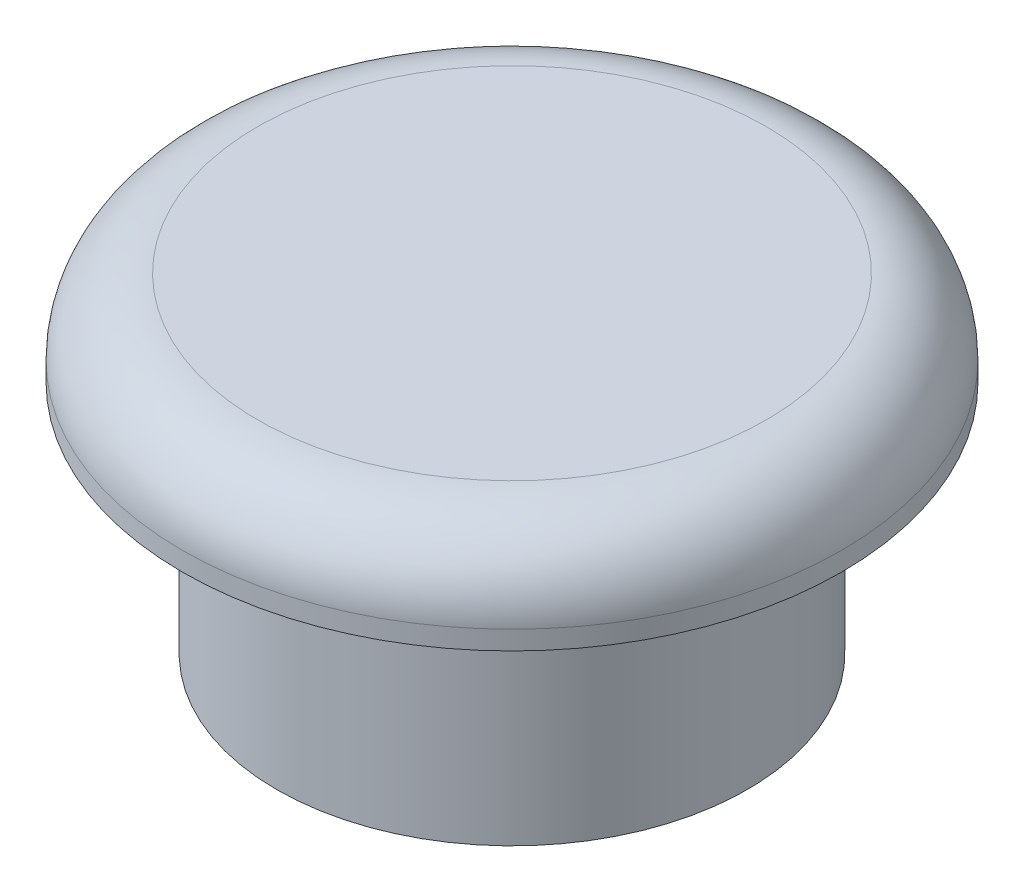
ISO-10303-21;
HEADER;
FILE_DESCRIPTION(('STEP AP214'),'2;1');
FILE_NAME('part.step','',(''),(''),'','','');
FILE_SCHEMA(('AUTOMOTIVE_DESIGN { 1 0 10303 214 1 1 1 1 }'));
ENDSEC;
DATA;
#1=APPLICATION_CONTEXT('core data for automotive mechanical design processes');
#2=APPLICATION_PROTOCOL_DEFINITION('international standard','automotive_design',2000,#1);
#3=PRODUCT_CONTEXT('',#1,'mechanical');
#4=PRODUCT('Part','Part','',(#3));
#5=PRODUCT_RELATED_PRODUCT_CATEGORY('part','',(#4));
#6=PRODUCT_DEFINITION_FORMATION('','',#4);
#7=PRODUCT_DEFINITION_CONTEXT('part definition',#1,'design');
#8=PRODUCT_DEFINITION('design','',#6,#7);
#9=PRODUCT_DEFINITION_SHAPE('','',#8);
#10=(LENGTH_UNIT() NAMED_UNIT(*) SI_UNIT(.MILLI.,.METRE.));
#11=(NAMED_UNIT(*) PLANE_ANGLE_UNIT() SI_UNIT($,.RADIAN.));
#12=(NAMED_UNIT(*) SI_UNIT($,.STERADIAN.) SOLID_ANGLE_UNIT());
#13=UNCERTAINTY_MEASURE_WITH_UNIT(LENGTH_MEASURE(1.E-05),#10,'distance_accuracy_value','');
#14=(GEOMETRIC_REPRESENTATION_CONTEXT(3) GLOBAL_UNCERTAINTY_ASSIGNED_CONTEXT((#13)) GLOBAL_UNIT_ASSIGNED_CONTEXT((#10,
#11,#12)) REPRESENTATION_CONTEXT('',''));
#15=CARTESIAN_POINT('',(0.,0.,0.));
#16=DIRECTION('',(0.,0.,1.));
#17=DIRECTION('',(1.,0.,0.));
#18=AXIS2_PLACEMENT_3D('',#15,#16,#17);
#19=CARTESIAN_POINT('',(2.5,0.,0.));
#20=DIRECTION('',(0.,1.,0.));
#21=DIRECTION('',(0.,0.,1.));
#22=AXIS2_PLACEMENT_3D('',#19,#20,#21);
#23=PLANE('',#22);
#24=CARTESIAN_POINT('',(0.,0.,0.));
#25=DIRECTION('',(0.,1.,0.));
#26=DIRECTION('',(0.,0.,1.));
#27=AXIS2_PLACEMENT_3D('',#24,#25,#26);
#28=CIRCLE('',#27,2.5);
#29=CARTESIAN_POINT('',(0.,0.,2.5));
#30=VERTEX_POINT('',#29);
#31=EDGE_CURVE('E85',#30,#30,#28,.T.);
#32=ORIENTED_EDGE('',*,*,#31,.F.);
#33=EDGE_LOOP('',(#32));
#34=FACE_BOUND('',#33,.T.);
#35=CARTESIAN_POINT('',(0.,0.,0.));
#36=DIRECTION('',(0.,1.,0.));
#37=DIRECTION('',(0.,0.,1.));
#38=AXIS2_PLACEMENT_3D('',#35,#36,#37);
#39=CIRCLE('',#38,1.5);
#40=CARTESIAN_POINT('',(0.,0.,1.5));
#41=VERTEX_POINT('',#40);
#42=EDGE_CURVE('E66',#41,#41,#39,.T.);
#43=ORIENTED_EDGE('',*,*,#42,.T.);
#44=EDGE_LOOP('',(#43));
#45=FACE_BOUND('',#44,.T.);
#46=ADVANCED_FACE('F51',(#34,#45),#23,.F.);
#47=CARTESIAN_POINT('',(0.,22.404093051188,0.));
#48=DIRECTION('',(0.,1.,0.));
#49=DIRECTION('',(0.,0.,1.));
#50=AXIS2_PLACEMENT_3D('',#47,#48,#49);
#51=CYLINDRICAL_SURFACE('',#50,1.5);
#52=ORIENTED_EDGE('',*,*,#42,.F.);
#53=EDGE_LOOP('',(#52));
#54=FACE_BOUND('',#53,.T.);
#55=CARTESIAN_POINT('',(0.,2.5,0.));
#56=DIRECTION('',(0.,1.,0.));
#57=DIRECTION('',(0.,0.,1.));
#58=AXIS2_PLACEMENT_3D('',#55,#56,#57);
#59=CIRCLE('',#58,1.5);
#60=CARTESIAN_POINT('',(0.,2.5,1.5));
#61=VERTEX_POINT('',#60);
#62=EDGE_CURVE('E73',#61,#61,#59,.T.);
#63=ORIENTED_EDGE('',*,*,#62,.T.);
#64=EDGE_LOOP('',(#63));
#65=FACE_BOUND('',#64,.T.);
#66=ADVANCED_FACE('F95',(#54,#65),#51,.F.);
#67=CARTESIAN_POINT('',(1.5,2.5,0.));
#68=DIRECTION('',(0.,1.,0.));
#69=DIRECTION('',(0.,0.,1.));
#70=AXIS2_PLACEMENT_3D('',#67,#68,#69);
#71=PLANE('',#70);
#72=ORIENTED_EDGE('',*,*,#62,.F.);
#73=EDGE_LOOP('',(#72));
#74=FACE_BOUND('',#73,.T.);
#75=ADVANCED_FACE('F100',(#74),#71,.F.);
#76=CARTESIAN_POINT('',(3.5,3.5,0.));
#77=DIRECTION('',(0.,-1.,0.));
#78=DIRECTION('',(0.,0.,-1.));
#79=AXIS2_PLACEMENT_3D('',#76,#77,#78);
#80=PLANE('',#79);
#81=CARTESIAN_POINT('',(0.,3.5,0.));
#82=DIRECTION('',(0.,-1.,0.));
#83=DIRECTION('',(0.,0.,-1.));
#84=AXIS2_PLACEMENT_3D('',#81,#82,#83);
#85=CIRCLE('',#84,2.7);
#86=CARTESIAN_POINT('',(0.,3.5,-2.7));
#87=VERTEX_POINT('',#86);
#88=EDGE_CURVE('E59',#87,#87,#85,.F.);
#89=ORIENTED_EDGE('',*,*,#88,.T.);
#90=EDGE_LOOP('',(#89));
#91=FACE_BOUND('',#90,.T.);
#92=ADVANCED_FACE('F105',(#91),#80,.F.);
#93=CARTESIAN_POINT('',(0.,22.404093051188,0.));
#94=DIRECTION('',(0.,1.,0.));
#95=DIRECTION('',(0.,0.,1.));
#96=AXIS2_PLACEMENT_3D('',#93,#94,#95);
#97=CYLINDRICAL_SURFACE('',#96,3.5);
#98=CARTESIAN_POINT('',(0.,2.7,0.));
#99=DIRECTION('',(0.,-1.,0.));
#100=DIRECTION('',(0.,0.,-1.));
#101=AXIS2_PLACEMENT_3D('',#98,#99,#100);
#102=CIRCLE('',#101,3.5);
#103=CARTESIAN_POINT('',(0.,2.7,-3.5));
#104=VERTEX_POINT('',#103);
#105=EDGE_CURVE('E10',#104,#104,#102,.T.);
#106=ORIENTED_EDGE('',*,*,#105,.T.);
#107=EDGE_LOOP('',(#106));
#108=FACE_BOUND('',#107,.T.);
#109=CARTESIAN_POINT('',(0.,2.5,0.));
#110=DIRECTION('',(0.,1.,0.));
#111=DIRECTION('',(0.,0.,1.));
#112=AXIS2_PLACEMENT_3D('',#109,#110,#111);
#113=CIRCLE('',#112,3.5);
#114=CARTESIAN_POINT('',(0.,2.5,3.5));
#115=VERTEX_POINT('',#114);
#116=EDGE_CURVE('E78',#115,#115,#113,.T.);
#117=ORIENTED_EDGE('',*,*,#116,.T.);
#118=EDGE_LOOP('',(#117));
#119=FACE_BOUND('',#118,.T.);
#120=ADVANCED_FACE('F109',(#108,#119),#97,.T.);
#121=CARTESIAN_POINT('',(2.5,2.5,0.));
#122=DIRECTION('',(0.,1.,0.));
#123=DIRECTION('',(0.,0.,1.));
#124=AXIS2_PLACEMENT_3D('',#121,#122,#123);
#125=PLANE('',#124);
#126=ORIENTED_EDGE('',*,*,#116,.F.);
#127=EDGE_LOOP('',(#126));
#128=FACE_BOUND('',#127,.T.);
#129=CARTESIAN_POINT('',(0.,2.5,0.));
#130=DIRECTION('',(0.,1.,0.));
#131=DIRECTION('',(0.,0.,1.));
#132=AXIS2_PLACEMENT_3D('',#129,#130,#131);
#133=CIRCLE('',#132,2.5);
#134=CARTESIAN_POINT('',(0.,2.5,2.5));
#135=VERTEX_POINT('',#134);
#136=EDGE_CURVE('E82',#135,#135,#133,.T.);
#137=ORIENTED_EDGE('',*,*,#136,.T.);
#138=EDGE_LOOP('',(#137));
#139=FACE_BOUND('',#138,.T.);
#140=ADVANCED_FACE('F114',(#128,#139),#125,.F.);
#141=CARTESIAN_POINT('',(0.,22.404093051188,0.));
#142=DIRECTION('',(0.,1.,0.));
#143=DIRECTION('',(0.,0.,1.));
#144=AXIS2_PLACEMENT_3D('',#141,#142,#143);
#145=CYLINDRICAL_SURFACE('',#144,2.5);
#146=ORIENTED_EDGE('',*,*,#136,.F.);
#147=EDGE_LOOP('',(#146));
#148=FACE_BOUND('',#147,.T.);
#149=ORIENTED_EDGE('',*,*,#31,.T.);
#150=EDGE_LOOP('',(#149));
#151=FACE_BOUND('',#150,.T.);
#152=ADVANCED_FACE('F91',(#148,#151),#145,.T.);
#153=CARTESIAN_POINT('',(0.,2.7,0.));
#154=DIRECTION('',(0.,-1.,0.));
#155=DIRECTION('',(0.,0.,-1.));
#156=AXIS2_PLACEMENT_3D('',#153,#154,#155);
#157=TOROIDAL_SURFACE('',#156,2.7,0.8);
#158=ORIENTED_EDGE('',*,*,#105,.F.);
#159=EDGE_LOOP('',(#158));
#160=FACE_BOUND('',#159,.T.);
#161=ORIENTED_EDGE('',*,*,#88,.F.);
#162=EDGE_LOOP('',(#161));
#163=FACE_BOUND('',#162,.T.);
#164=ADVANCED_FACE('F53',(#160,#163),#157,.T.);
#165=CLOSED_SHELL('',(#46,#66,#75,#92,#120,#140,#152,#164));
#166=MANIFOLD_SOLID_BREP('B2',#165);
#167=ADVANCED_BREP_SHAPE_REPRESENTATION('',(#18,#166),#14);
#168=SHAPE_DEFINITION_REPRESENTATION(#9,#167);
ENDSEC;
END-ISO-10303-21;
